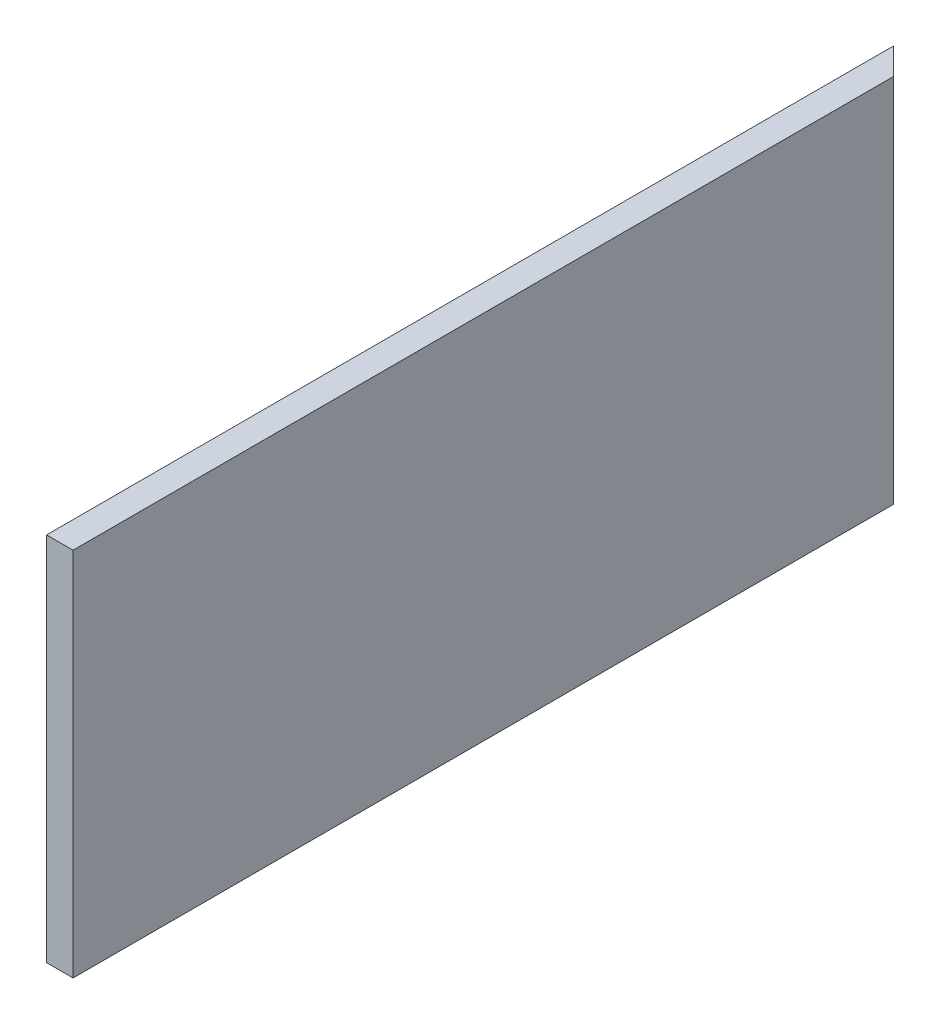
ISO-10303-21;
HEADER;
FILE_DESCRIPTION(('STEP AP214'),'2;1');
FILE_NAME('part.step','',(''),(''),'','','');
FILE_SCHEMA(('AUTOMOTIVE_DESIGN { 1 0 10303 214 1 1 1 1 }'));
ENDSEC;
DATA;
#1=APPLICATION_CONTEXT('core data for automotive mechanical design processes');
#2=APPLICATION_PROTOCOL_DEFINITION('international standard','automotive_design',2000,#1);
#3=PRODUCT_CONTEXT('',#1,'mechanical');
#4=PRODUCT('Part','Part','',(#3));
#5=PRODUCT_RELATED_PRODUCT_CATEGORY('part','',(#4));
#6=PRODUCT_DEFINITION_FORMATION('','',#4);
#7=PRODUCT_DEFINITION_CONTEXT('part definition',#1,'design');
#8=PRODUCT_DEFINITION('design','',#6,#7);
#9=PRODUCT_DEFINITION_SHAPE('','',#8);
#10=(LENGTH_UNIT() NAMED_UNIT(*) SI_UNIT(.MILLI.,.METRE.));
#11=(NAMED_UNIT(*) PLANE_ANGLE_UNIT() SI_UNIT($,.RADIAN.));
#12=(NAMED_UNIT(*) SI_UNIT($,.STERADIAN.) SOLID_ANGLE_UNIT());
#13=UNCERTAINTY_MEASURE_WITH_UNIT(LENGTH_MEASURE(1.E-05),#10,'distance_accuracy_value','');
#14=(GEOMETRIC_REPRESENTATION_CONTEXT(3) GLOBAL_UNCERTAINTY_ASSIGNED_CONTEXT((#13)) GLOBAL_UNIT_ASSIGNED_CONTEXT((#10,
#11,#12)) REPRESENTATION_CONTEXT('',''));
#15=CARTESIAN_POINT('',(0.,0.,0.));
#16=DIRECTION('',(0.,0.,1.));
#17=DIRECTION('',(1.,0.,0.));
#18=AXIS2_PLACEMENT_3D('',#15,#16,#17);
#19=CARTESIAN_POINT('',(0.,355.6,0.));
#20=DIRECTION('',(1.,0.,0.));
#21=DIRECTION('',(0.,0.,-1.));
#22=AXIS2_PLACEMENT_3D('',#19,#20,#21);
#23=PLANE('',#22);
#24=DIRECTION('',(0.,0.,1.));
#25=VECTOR('',#24,1.);
#26=CARTESIAN_POINT('',(0.,0.,0.));
#27=LINE('',#26,#25);
#28=CARTESIAN_POINT('',(0.,0.,-812.8));
#29=VERTEX_POINT('',#28);
#30=CARTESIAN_POINT('',(0.,0.,0.));
#31=VERTEX_POINT('',#30);
#32=EDGE_CURVE('E102',#29,#31,#27,.T.);
#33=ORIENTED_EDGE('',*,*,#32,.T.);
#34=DIRECTION('',(0.,-1.,0.));
#35=VECTOR('',#34,1.);
#36=CARTESIAN_POINT('',(0.,355.6,0.));
#37=LINE('',#36,#35);
#38=CARTESIAN_POINT('',(0.,355.6,0.));
#39=VERTEX_POINT('',#38);
#40=EDGE_CURVE('E11',#39,#31,#37,.T.);
#41=ORIENTED_EDGE('',*,*,#40,.F.);
#42=DIRECTION('',(0.,0.,1.));
#43=VECTOR('',#42,1.);
#44=CARTESIAN_POINT('',(0.,355.6,0.));
#45=LINE('',#44,#43);
#46=CARTESIAN_POINT('',(0.,355.6,-812.8));
#47=VERTEX_POINT('',#46);
#48=EDGE_CURVE('E90',#47,#39,#45,.T.);
#49=ORIENTED_EDGE('',*,*,#48,.F.);
#50=DIRECTION('',(0.,-1.,0.));
#51=VECTOR('',#50,1.);
#52=CARTESIAN_POINT('',(0.,355.6,-812.8));
#53=LINE('',#52,#51);
#54=EDGE_CURVE('E98',#47,#29,#53,.T.);
#55=ORIENTED_EDGE('',*,*,#54,.T.);
#56=EDGE_LOOP('',(#33,#41,#49,#55));
#57=FACE_BOUND('',#56,.T.);
#58=ADVANCED_FACE('F39',(#57),#23,.F.);
#59=CARTESIAN_POINT('',(0.,355.6,0.));
#60=DIRECTION('',(0.,0.,-1.));
#61=DIRECTION('',(-1.,0.,0.));
#62=AXIS2_PLACEMENT_3D('',#59,#60,#61);
#63=PLANE('',#62);
#64=DIRECTION('',(1.,0.,0.));
#65=VECTOR('',#64,1.);
#66=CARTESIAN_POINT('',(0.,0.,0.));
#67=LINE('',#66,#65);
#68=CARTESIAN_POINT('',(25.4,0.,0.));
#69=VERTEX_POINT('',#68);
#70=EDGE_CURVE('E94',#31,#69,#67,.T.);
#71=ORIENTED_EDGE('',*,*,#70,.T.);
#72=DIRECTION('',(0.,-1.,0.));
#73=VECTOR('',#72,1.);
#74=CARTESIAN_POINT('',(25.4,355.6,0.));
#75=LINE('',#74,#73);
#76=CARTESIAN_POINT('',(25.4,355.6,0.));
#77=VERTEX_POINT('',#76);
#78=EDGE_CURVE('E47',#77,#69,#75,.T.);
#79=ORIENTED_EDGE('',*,*,#78,.F.);
#80=DIRECTION('',(1.,0.,0.));
#81=VECTOR('',#80,1.);
#82=CARTESIAN_POINT('',(0.,355.6,0.));
#83=LINE('',#82,#81);
#84=EDGE_CURVE('E85',#39,#77,#83,.T.);
#85=ORIENTED_EDGE('',*,*,#84,.F.);
#86=ORIENTED_EDGE('',*,*,#40,.T.);
#87=EDGE_LOOP('',(#71,#79,#85,#86));
#88=FACE_BOUND('',#87,.T.);
#89=ADVANCED_FACE('F93',(#88),#63,.F.);
#90=CARTESIAN_POINT('',(25.4,355.6,0.));
#91=DIRECTION('',(-1.,0.,0.));
#92=DIRECTION('',(0.,0.,1.));
#93=AXIS2_PLACEMENT_3D('',#90,#91,#92);
#94=PLANE('',#93);
#95=DIRECTION('',(0.,0.,-1.));
#96=VECTOR('',#95,1.);
#97=CARTESIAN_POINT('',(25.4,0.,0.));
#98=LINE('',#97,#96);
#99=CARTESIAN_POINT('',(25.4,0.,-787.4));
#100=VERTEX_POINT('',#99);
#101=EDGE_CURVE('E72',#69,#100,#98,.T.);
#102=ORIENTED_EDGE('',*,*,#101,.T.);
#103=DIRECTION('',(0.,-1.,0.));
#104=VECTOR('',#103,1.);
#105=CARTESIAN_POINT('',(25.4,355.6,-787.4));
#106=LINE('',#105,#104);
#107=CARTESIAN_POINT('',(25.4,355.6,-787.4));
#108=VERTEX_POINT('',#107);
#109=EDGE_CURVE('E95',#108,#100,#106,.T.);
#110=ORIENTED_EDGE('',*,*,#109,.F.);
#111=DIRECTION('',(0.,0.,-1.));
#112=VECTOR('',#111,1.);
#113=CARTESIAN_POINT('',(25.4,355.6,0.));
#114=LINE('',#113,#112);
#115=EDGE_CURVE('E88',#77,#108,#114,.T.);
#116=ORIENTED_EDGE('',*,*,#115,.F.);
#117=ORIENTED_EDGE('',*,*,#78,.T.);
#118=EDGE_LOOP('',(#102,#110,#116,#117));
#119=FACE_BOUND('',#118,.T.);
#120=ADVANCED_FACE('F96',(#119),#94,.F.);
#121=CARTESIAN_POINT('',(25.4,355.6,-787.4));
#122=DIRECTION('',(-0.707106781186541,0.,0.707106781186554));
#123=DIRECTION('',(0.707106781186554,0.,0.707106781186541));
#124=AXIS2_PLACEMENT_3D('',#121,#122,#123);
#125=PLANE('',#124);
#126=DIRECTION('',(-0.707106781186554,0.,-0.707106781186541));
#127=VECTOR('',#126,1.);
#128=CARTESIAN_POINT('',(25.4,0.,-787.4));
#129=LINE('',#128,#127);
#130=EDGE_CURVE('E78',#100,#29,#129,.T.);
#131=ORIENTED_EDGE('',*,*,#130,.T.);
#132=ORIENTED_EDGE('',*,*,#54,.F.);
#133=DIRECTION('',(-0.707106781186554,0.,-0.707106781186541));
#134=VECTOR('',#133,1.);
#135=CARTESIAN_POINT('',(25.4,355.6,-787.4));
#136=LINE('',#135,#134);
#137=EDGE_CURVE('E55',#108,#47,#136,.T.);
#138=ORIENTED_EDGE('',*,*,#137,.F.);
#139=ORIENTED_EDGE('',*,*,#109,.T.);
#140=EDGE_LOOP('',(#131,#132,#138,#139));
#141=FACE_BOUND('',#140,.T.);
#142=ADVANCED_FACE('F109',(#141),#125,.F.);
#143=CARTESIAN_POINT('',(0.,355.6,0.));
#144=DIRECTION('',(0.,-1.,0.));
#145=DIRECTION('',(0.,0.,-1.));
#146=AXIS2_PLACEMENT_3D('',#143,#144,#145);
#147=PLANE('',#146);
#148=ORIENTED_EDGE('',*,*,#48,.T.);
#149=ORIENTED_EDGE('',*,*,#84,.T.);
#150=ORIENTED_EDGE('',*,*,#115,.T.);
#151=ORIENTED_EDGE('',*,*,#137,.T.);
#152=EDGE_LOOP('',(#148,#149,#150,#151));
#153=FACE_BOUND('',#152,.T.);
#154=ADVANCED_FACE('F86',(#153),#147,.F.);
#155=CARTESIAN_POINT('',(0.,0.,0.));
#156=DIRECTION('',(0.,-1.,0.));
#157=DIRECTION('',(0.,0.,-1.));
#158=AXIS2_PLACEMENT_3D('',#155,#156,#157);
#159=PLANE('',#158);
#160=ORIENTED_EDGE('',*,*,#32,.F.);
#161=ORIENTED_EDGE('',*,*,#130,.F.);
#162=ORIENTED_EDGE('',*,*,#101,.F.);
#163=ORIENTED_EDGE('',*,*,#70,.F.);
#164=EDGE_LOOP('',(#160,#161,#162,#163));
#165=FACE_BOUND('',#164,.T.);
#166=ADVANCED_FACE('F112',(#165),#159,.T.);
#167=CLOSED_SHELL('',(#58,#89,#120,#142,#154,#166));
#168=MANIFOLD_SOLID_BREP('B2',#167);
#169=ADVANCED_BREP_SHAPE_REPRESENTATION('',(#18,#168),#14);
#170=SHAPE_DEFINITION_REPRESENTATION(#9,#169);
ENDSEC;
END-ISO-10303-21;
